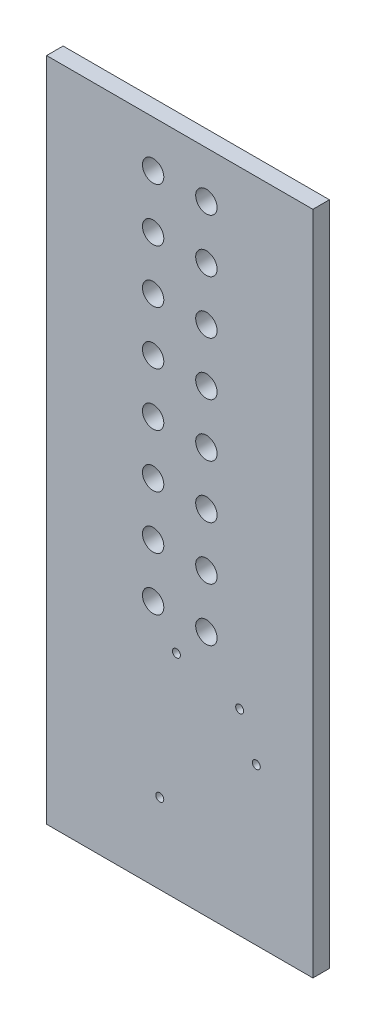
from build123d import *

# Parameters (mm, degrees)
SKETCH1_W           = 12.7
SKETCH1_H           = 31.75
BOARD_OUTLINE_DEPTH = 0.7874
SKETCH2_R           = 0.1905
NPTH_DEPTH          = 35.204860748
SKETCH3_R           = 0.51
PTH_DEPTH           = 35.204860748


with BuildPart() as part:
    # Sketch1 → Board_Outline (new body)
    with BuildSketch(Plane.XY):
        with Locations((6.35, 15.875)):
            Rectangle(SKETCH1_W, SKETCH1_H)
    extrude(amount=BOARD_OUTLINE_DEPTH)

    # Sketch2 → NPTH (cut, through all)
    with BuildSketch(Plane.XY):
        with Locations((10.0013, 7.4613)):
            Circle(SKETCH2_R)
        with Locations((9.2075, 9.3663)):
            Circle(SKETCH2_R)
        with Locations((5.3975, 3.81)):
            Circle(SKETCH2_R)
        with Locations((6.1913, 10.16)):
            Circle(SKETCH2_R)
    extrude(amount=NPTH_DEPTH, mode=Mode.SUBTRACT)

    # Sketch3 → PTH (cut, through all)
    with BuildSketch(Plane.XY):
        with Locations((7.62, 11.75)):
            Circle(SKETCH3_R)
        with Locations((7.62, 14.29)):
            Circle(SKETCH3_R)
        with Locations((7.62, 16.83)):
            Circle(SKETCH3_R)
        with Locations((7.62, 19.37)):
            Circle(SKETCH3_R)
        with Locations((7.62, 21.91)):
            Circle(SKETCH3_R)
        with Locations((7.62, 24.45)):
            Circle(SKETCH3_R)
        with Locations((7.62, 26.99)):
            Circle(SKETCH3_R)
        with Locations((7.62, 29.53)):
            Circle(SKETCH3_R)
        with Locations((5.08, 11.75)):
            Circle(SKETCH3_R)
        with Locations((5.08, 14.29)):
            Circle(SKETCH3_R)
        with Locations((5.08, 16.83)):
            Circle(SKETCH3_R)
        with Locations((5.08, 19.37)):
            Circle(SKETCH3_R)
        with Locations((5.08, 21.91)):
            Circle(SKETCH3_R)
        with Locations((5.08, 24.45)):
            Circle(SKETCH3_R)
        with Locations((5.08, 26.99)):
            Circle(SKETCH3_R)
        with Locations((5.08, 29.53)):
            Circle(SKETCH3_R)
    extrude(amount=PTH_DEPTH, mode=Mode.SUBTRACT)


solid = part.part
